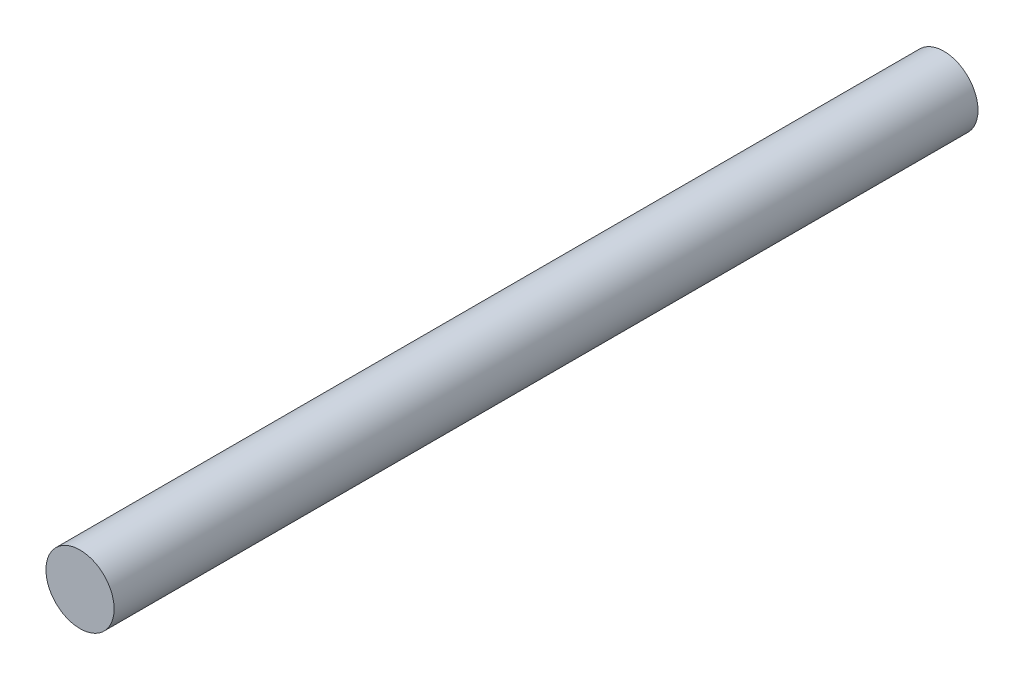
from build123d import *

# Parameters (mm, degrees)
SKETCH1_R           = 2.38125
BOSS_EXTRUDE1_DEPTH = 60.325


with BuildPart() as part:
    # Sketch1 → Boss-Extrude1 (new body)
    with BuildSketch(Plane.XY):
        Circle(SKETCH1_R)
    extrude(amount=-BOSS_EXTRUDE1_DEPTH)


solid = part.part
